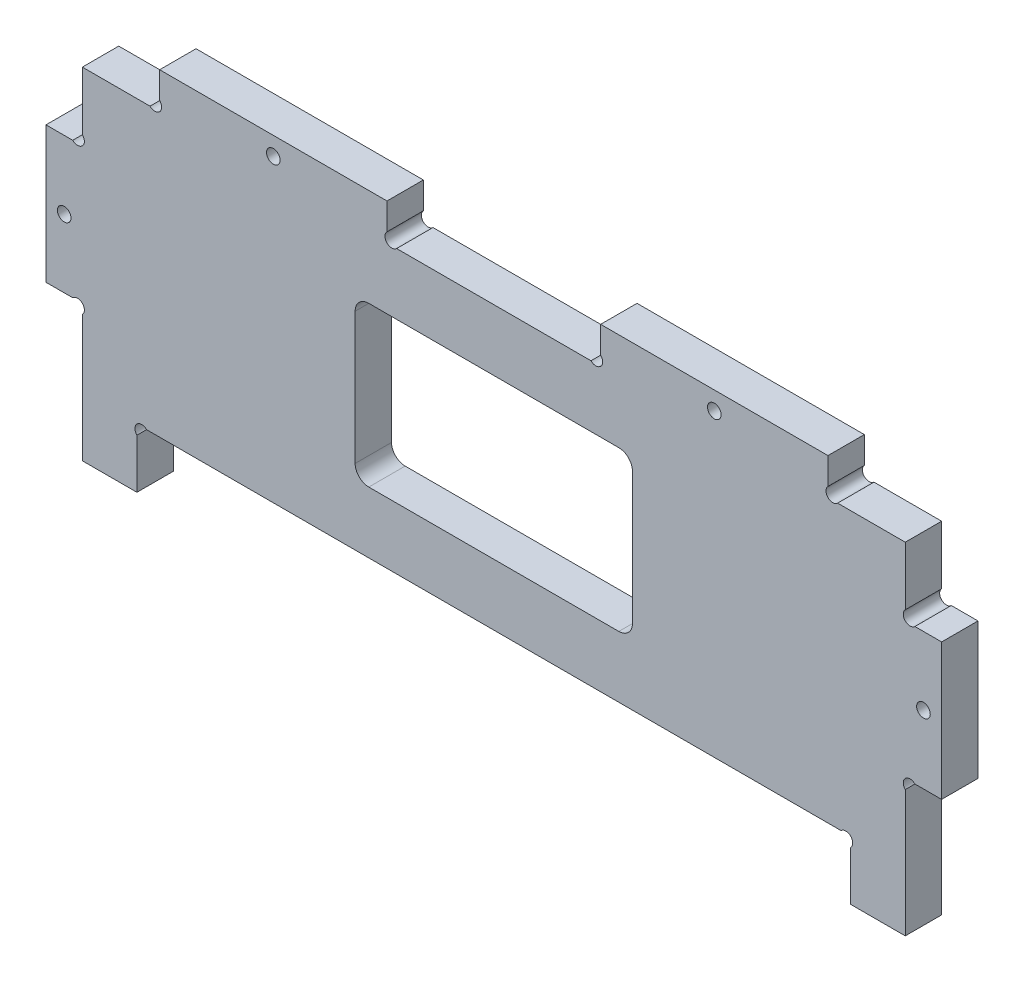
from build123d import *

# Parameters (mm, degrees)
ESQUISSE1_R        = 1.5
ESQUISSE1_W        = 61
ESQUISSE1_H        = 35
BOSS_EXTRU_1_DEPTH = 8
CONG_1_R           = 3


with BuildPart() as part:
    # Esquisse1 → Boss.-Extru.1 (new body)
    with BuildSketch(Plane.XY):
        with BuildLine():
            Line((-21.043081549, -36.536710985), (24.714277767, -36.536710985))
            Line((24.714277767, -36.536710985), (131.714277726, -36.536710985))
            ThreePointArc((131.714277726, -36.536710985), (133.835598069, -36.536710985), (133.835598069, -38.658031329))
            Line((133.835598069, -38.658031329), (133.835598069, -49.536710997))
            Line((133.835598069, -49.536710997), (145.835598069, -49.536710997))
            Line((145.835598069, -49.536710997), (145.835598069, -36.536710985))
            Line((145.835598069, -36.536710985), (145.835598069, -22.097371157))
            Line((145.835598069, -22.097371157), (145.835598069, -21.658031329))
            ThreePointArc((145.835598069, -21.658031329), (145.835598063, -19.536710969), (147.956918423, -19.536710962))
            Line((147.956918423, -19.536710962), (153.835598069, -19.536710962))
            Line((153.835598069, -19.536710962), (153.835598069, 10.463289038))
            Line((153.835598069, 10.463289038), (147.956918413, 10.463289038))
            ThreePointArc((147.956918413, 10.463289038), (145.835598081, 10.463289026), (145.835598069, 12.584609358))
            Line((145.835598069, 12.584609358), (145.835598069, 13.023949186))
            Line((145.835598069, 13.023949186), (145.835598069, 25.463289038))
            Line((145.835598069, 25.463289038), (130.956918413, 25.463289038))
            ThreePointArc((130.956918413, 25.463289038), (128.83559807, 25.463289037), (128.835598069, 27.58460938))
            Line((128.835598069, 27.58460938), (128.835598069, 33.463289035))
            Line((128.835598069, 33.463289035), (78.835598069, 33.463289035))
            Line((78.835598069, 33.463289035), (78.835598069, 27.584609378))
            ThreePointArc((78.835598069, 27.584609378), (78.835598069, 25.463289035), (76.714277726, 25.463289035))
            Line((76.714277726, 25.463289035), (33.956918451, 25.463289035))
            ThreePointArc((33.956918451, 25.463289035), (31.835598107, 25.463289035), (31.835598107, 27.584609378))
            Line((31.835598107, 27.584609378), (31.835598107, 33.463289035))
            Line((31.835598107, 33.463289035), (-18.164401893, 33.463289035))
            Line((-18.164401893, 33.463289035), (-18.164401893, 27.58460938))
            ThreePointArc((-18.164401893, 27.58460938), (-18.164401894, 25.463289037), (-20.285722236, 25.463289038))
            Line((-20.285722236, 25.463289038), (-35.164401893, 25.463289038))
            Line((-35.164401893, 25.463289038), (-35.164401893, 13.023949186))
            Line((-35.164401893, 13.023949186), (-35.164401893, 12.584609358))
            ThreePointArc((-35.164401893, 12.584609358), (-35.164401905, 10.463289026), (-37.285722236, 10.463289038))
            Line((-37.285722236, 10.463289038), (-43.164401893, 10.463289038))
            Line((-43.164401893, 10.463289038), (-43.164401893, -19.536710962))
            Line((-43.164401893, -19.536710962), (-37.285722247, -19.536710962))
            ThreePointArc((-37.285722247, -19.536710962), (-35.164401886, -19.536710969), (-35.164401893, -21.658031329))
            Line((-35.164401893, -21.658031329), (-35.164401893, -22.097371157))
            Line((-35.164401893, -22.097371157), (-35.164401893, -36.536710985))
            Line((-35.164401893, -36.536710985), (-35.164401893, -49.536710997))
            Line((-35.164401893, -49.536710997), (-23.164401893, -49.536710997))
            Line((-23.164401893, -49.536710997), (-23.164401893, -38.658031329))
            ThreePointArc((-23.164401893, -38.658031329), (-23.164401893, -36.536710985), (-21.043081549, -36.536710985))
        make_face()
        with Locations(Location((-39.164401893, -4.536710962, 0), (0, 0, 180))):
            Circle(ESQUISSE1_R, mode=Mode.SUBTRACT)
        with Locations(Location((6.835598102, 29.463289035, 0), (0, 0, 180))):
            Circle(ESQUISSE1_R, mode=Mode.SUBTRACT)
        with Locations((103.835598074, 29.463289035)):
            Circle(ESQUISSE1_R, mode=Mode.SUBTRACT)
        with Locations((149.835598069, -4.536710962)):
            Circle(ESQUISSE1_R, mode=Mode.SUBTRACT)
        with Locations((55.335598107, -5.536710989)):
            Rectangle(ESQUISSE1_W, ESQUISSE1_H, mode=Mode.SUBTRACT)
    extrude(amount=BOSS_EXTRU_1_DEPTH)

    # Cong_1
    cong_1_edges = [part.edges().sort_by_distance(p)[0] for p in [
        (24.835598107, 11.963289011, 4),
        (24.835598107, -23.036710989, 4),
        (85.835598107, -23.036710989, 4),
        (85.835598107, 11.963289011, 4),
    ]]
    fillet(cong_1_edges, radius=CONG_1_R)


solid = part.part
